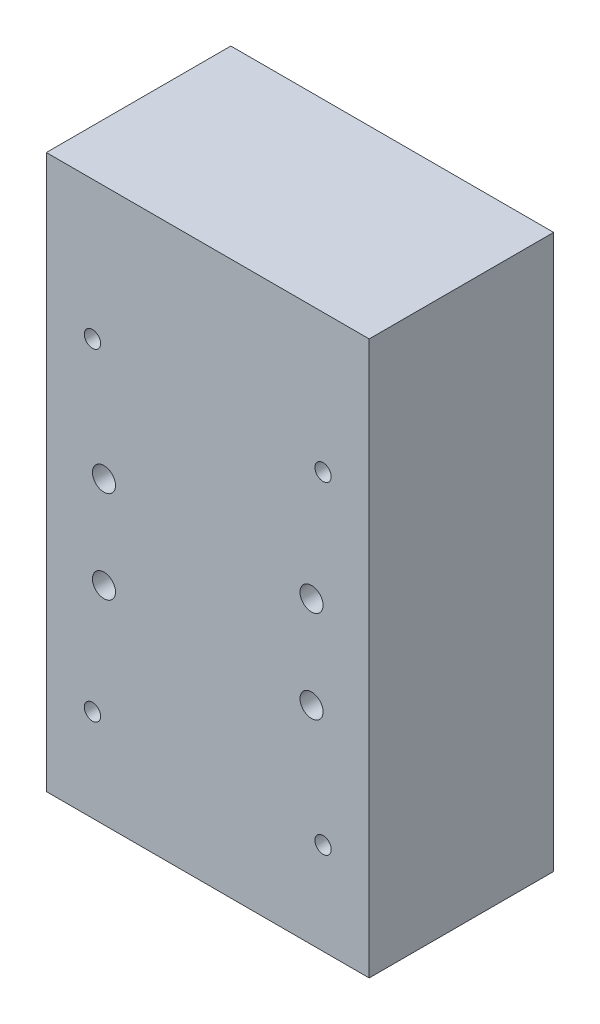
from build123d import *

# Parameters (mm, degrees)
SKETCH1_W                                         = 88.9
SKETCH1_H                                         = 50.8
BOSS_EXTRUDE1_DEPTH                               = 152.4
CSK_FOR_8_FLAT_HEAD_MACHINE_SCREW_100_D           = 4.4958
CSK_FOR_8_FLAT_HEAD_MACHINE_SCREW_100_CSINK_D     = 8.4328
CSK_FOR_8_FLAT_HEAD_MACHINE_SCREW_100_CSINK_ANGLE = 100
SKETCH4_R                                         = 3.175
CUT_EXTRUDE1_DEPTH                                = 107.666067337


with BuildPart() as part:
    # Sketch1 → Boss-Extrude1 (new body)
    with BuildSketch(Plane(origin=(0, 0, 0), x_dir=(1, 0, 0), z_dir=(0, 1, 0))):
        Rectangle(SKETCH1_W, SKETCH1_H)
    extrude(amount=BOSS_EXTRUDE1_DEPTH)

    # CSK for _8 Flat Head Machine Screw _100 (through all)
    with Locations(Plane(origin=(0, 0, -25.4), x_dir=(-1, 0, 0), z_dir=(0, 0, -1))):
        with Locations((-31.75, 114.3), (31.75, 114.3), (-31.75, 25.4), (31.75, 25.4)):
            CounterSinkHole(CSK_FOR_8_FLAT_HEAD_MACHINE_SCREW_100_D / 2, CSK_FOR_8_FLAT_HEAD_MACHINE_SCREW_100_CSINK_D / 2, counter_sink_angle=CSK_FOR_8_FLAT_HEAD_MACHINE_SCREW_100_CSINK_ANGLE)

    # Sketch4 → Cut-Extrude1 (cut, through all)
    with BuildSketch(Plane(origin=(0, 69.809398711, -25.4), x_dir=(-1, 0, 0), z_dir=(0, 0, 1))):
        with Locations(Location((-28.575, 12.7, 0), (0, 0, 180))):
            Circle(SKETCH4_R)
        with Locations((-28.575, -12.7)):
            Circle(SKETCH4_R)
        with Locations(Location((28.575, -12.7, 0), (0, 0, 180))):
            Circle(SKETCH4_R)
        with Locations((28.575, 12.7)):
            Circle(SKETCH4_R)
    extrude(amount=CUT_EXTRUDE1_DEPTH, mode=Mode.SUBTRACT)


solid = part.part
